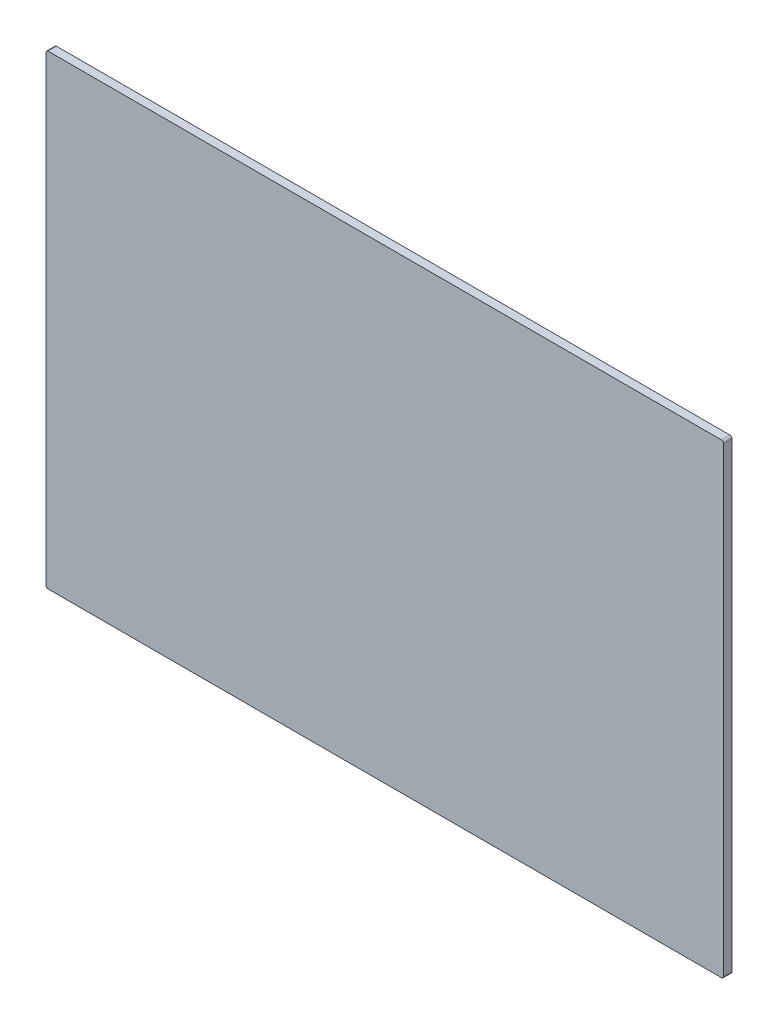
ISO-10303-21;
HEADER;
FILE_DESCRIPTION(('STEP AP214'),'2;1');
FILE_NAME('part.step','',(''),(''),'','','');
FILE_SCHEMA(('AUTOMOTIVE_DESIGN { 1 0 10303 214 1 1 1 1 }'));
ENDSEC;
DATA;
#1=APPLICATION_CONTEXT('core data for automotive mechanical design processes');
#2=APPLICATION_PROTOCOL_DEFINITION('international standard','automotive_design',2000,#1);
#3=PRODUCT_CONTEXT('',#1,'mechanical');
#4=PRODUCT('Part','Part','',(#3));
#5=PRODUCT_RELATED_PRODUCT_CATEGORY('part','',(#4));
#6=PRODUCT_DEFINITION_FORMATION('','',#4);
#7=PRODUCT_DEFINITION_CONTEXT('part definition',#1,'design');
#8=PRODUCT_DEFINITION('design','',#6,#7);
#9=PRODUCT_DEFINITION_SHAPE('','',#8);
#10=(LENGTH_UNIT() NAMED_UNIT(*) SI_UNIT(.MILLI.,.METRE.));
#11=(NAMED_UNIT(*) PLANE_ANGLE_UNIT() SI_UNIT($,.RADIAN.));
#12=(NAMED_UNIT(*) SI_UNIT($,.STERADIAN.) SOLID_ANGLE_UNIT());
#13=UNCERTAINTY_MEASURE_WITH_UNIT(LENGTH_MEASURE(1.E-05),#10,'distance_accuracy_value','');
#14=(GEOMETRIC_REPRESENTATION_CONTEXT(3) GLOBAL_UNCERTAINTY_ASSIGNED_CONTEXT((#13)) GLOBAL_UNIT_ASSIGNED_CONTEXT((#10,
#11,#12)) REPRESENTATION_CONTEXT('',''));
#15=CARTESIAN_POINT('',(0.,0.,0.));
#16=DIRECTION('',(0.,0.,1.));
#17=DIRECTION('',(1.,0.,0.));
#18=AXIS2_PLACEMENT_3D('',#15,#16,#17);
#19=CARTESIAN_POINT('',(1.5,1.5,6.));
#20=DIRECTION('',(0.,0.,-1.));
#21=DIRECTION('',(-1.,0.,0.));
#22=AXIS2_PLACEMENT_3D('',#19,#20,#21);
#23=CYLINDRICAL_SURFACE('',#22,1.5);
#24=CARTESIAN_POINT('',(1.5,1.5,0.));
#25=DIRECTION('',(0.,0.,1.));
#26=DIRECTION('',(1.,0.,0.));
#27=AXIS2_PLACEMENT_3D('',#24,#25,#26);
#28=CIRCLE('',#27,1.5);
#29=CARTESIAN_POINT('',(0.,1.50000000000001,0.));
#30=VERTEX_POINT('',#29);
#31=CARTESIAN_POINT('',(1.50000000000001,0.,0.));
#32=VERTEX_POINT('',#31);
#33=EDGE_CURVE('E94',#30,#32,#28,.T.);
#34=ORIENTED_EDGE('',*,*,#33,.T.);
#35=DIRECTION('',(0.,0.,-1.));
#36=VECTOR('',#35,1.);
#37=CARTESIAN_POINT('',(1.50000000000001,0.,6.));
#38=LINE('',#37,#36);
#39=CARTESIAN_POINT('',(1.50000000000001,0.,6.));
#40=VERTEX_POINT('',#39);
#41=EDGE_CURVE('E11',#40,#32,#38,.T.);
#42=ORIENTED_EDGE('',*,*,#41,.F.);
#43=CARTESIAN_POINT('',(1.5,1.5,6.));
#44=DIRECTION('',(0.,0.,1.));
#45=DIRECTION('',(1.,0.,0.));
#46=AXIS2_PLACEMENT_3D('',#43,#44,#45);
#47=CIRCLE('',#46,1.5);
#48=CARTESIAN_POINT('',(0.,1.50000000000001,6.));
#49=VERTEX_POINT('',#48);
#50=EDGE_CURVE('E121',#49,#40,#47,.T.);
#51=ORIENTED_EDGE('',*,*,#50,.F.);
#52=DIRECTION('',(0.,0.,-1.));
#53=VECTOR('',#52,1.);
#54=CARTESIAN_POINT('',(0.,1.50000000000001,6.));
#55=LINE('',#54,#53);
#56=EDGE_CURVE('E107',#49,#30,#55,.T.);
#57=ORIENTED_EDGE('',*,*,#56,.T.);
#58=EDGE_LOOP('',(#34,#42,#51,#57));
#59=FACE_BOUND('',#58,.T.);
#60=ADVANCED_FACE('F26',(#59),#23,.T.);
#61=CARTESIAN_POINT('',(1.50000000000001,0.,6.));
#62=DIRECTION('',(0.,1.,0.));
#63=DIRECTION('',(0.,0.,1.));
#64=AXIS2_PLACEMENT_3D('',#61,#62,#63);
#65=PLANE('',#64);
#66=DIRECTION('',(1.,0.,0.));
#67=VECTOR('',#66,1.);
#68=CARTESIAN_POINT('',(1.50000000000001,0.,0.));
#69=LINE('',#68,#67);
#70=CARTESIAN_POINT('',(478.5,0.,0.));
#71=VERTEX_POINT('',#70);
#72=EDGE_CURVE('E90',#32,#71,#69,.T.);
#73=ORIENTED_EDGE('',*,*,#72,.T.);
#74=DIRECTION('',(0.,0.,-1.));
#75=VECTOR('',#74,1.);
#76=CARTESIAN_POINT('',(478.5,0.,6.));
#77=LINE('',#76,#75);
#78=CARTESIAN_POINT('',(478.5,0.,6.));
#79=VERTEX_POINT('',#78);
#80=EDGE_CURVE('E33',#79,#71,#77,.T.);
#81=ORIENTED_EDGE('',*,*,#80,.F.);
#82=DIRECTION('',(1.,0.,0.));
#83=VECTOR('',#82,1.);
#84=CARTESIAN_POINT('',(1.50000000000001,0.,6.));
#85=LINE('',#84,#83);
#86=EDGE_CURVE('E103',#40,#79,#85,.T.);
#87=ORIENTED_EDGE('',*,*,#86,.F.);
#88=ORIENTED_EDGE('',*,*,#41,.T.);
#89=EDGE_LOOP('',(#73,#81,#87,#88));
#90=FACE_BOUND('',#89,.T.);
#91=ADVANCED_FACE('F102',(#90),#65,.F.);
#92=CARTESIAN_POINT('',(478.5,1.5,6.));
#93=DIRECTION('',(0.,0.,-1.));
#94=DIRECTION('',(-1.,0.,0.));
#95=AXIS2_PLACEMENT_3D('',#92,#93,#94);
#96=CYLINDRICAL_SURFACE('',#95,1.5);
#97=CARTESIAN_POINT('',(478.5,1.5,0.));
#98=DIRECTION('',(0.,0.,1.));
#99=DIRECTION('',(1.,0.,0.));
#100=AXIS2_PLACEMENT_3D('',#97,#98,#99);
#101=CIRCLE('',#100,1.5);
#102=CARTESIAN_POINT('',(480.,1.5,0.));
#103=VERTEX_POINT('',#102);
#104=EDGE_CURVE('E96',#71,#103,#101,.T.);
#105=ORIENTED_EDGE('',*,*,#104,.T.);
#106=DIRECTION('',(0.,0.,-1.));
#107=VECTOR('',#106,1.);
#108=CARTESIAN_POINT('',(480.,1.5,6.));
#109=LINE('',#108,#107);
#110=CARTESIAN_POINT('',(480.,1.5,6.));
#111=VERTEX_POINT('',#110);
#112=EDGE_CURVE('E147',#111,#103,#109,.T.);
#113=ORIENTED_EDGE('',*,*,#112,.F.);
#114=CARTESIAN_POINT('',(478.5,1.5,6.));
#115=DIRECTION('',(0.,0.,1.));
#116=DIRECTION('',(1.,0.,0.));
#117=AXIS2_PLACEMENT_3D('',#114,#115,#116);
#118=CIRCLE('',#117,1.5);
#119=EDGE_CURVE('E124',#79,#111,#118,.T.);
#120=ORIENTED_EDGE('',*,*,#119,.F.);
#121=ORIENTED_EDGE('',*,*,#80,.T.);
#122=EDGE_LOOP('',(#105,#113,#120,#121));
#123=FACE_BOUND('',#122,.T.);
#124=ADVANCED_FACE('F151',(#123),#96,.T.);
#125=CARTESIAN_POINT('',(480.,1.5,6.));
#126=DIRECTION('',(-1.,0.,0.));
#127=DIRECTION('',(0.,0.,1.));
#128=AXIS2_PLACEMENT_3D('',#125,#126,#127);
#129=PLANE('',#128);
#130=DIRECTION('',(0.,1.,0.));
#131=VECTOR('',#130,1.);
#132=CARTESIAN_POINT('',(480.,1.5,0.));
#133=LINE('',#132,#131);
#134=CARTESIAN_POINT('',(480.,328.5,0.));
#135=VERTEX_POINT('',#134);
#136=EDGE_CURVE('E111',#103,#135,#133,.T.);
#137=ORIENTED_EDGE('',*,*,#136,.T.);
#138=DIRECTION('',(0.,0.,-1.));
#139=VECTOR('',#138,1.);
#140=CARTESIAN_POINT('',(480.,328.5,6.));
#141=LINE('',#140,#139);
#142=CARTESIAN_POINT('',(480.,328.5,6.));
#143=VERTEX_POINT('',#142);
#144=EDGE_CURVE('E144',#143,#135,#141,.T.);
#145=ORIENTED_EDGE('',*,*,#144,.F.);
#146=DIRECTION('',(0.,1.,0.));
#147=VECTOR('',#146,1.);
#148=CARTESIAN_POINT('',(480.,1.5,6.));
#149=LINE('',#148,#147);
#150=EDGE_CURVE('E126',#111,#143,#149,.T.);
#151=ORIENTED_EDGE('',*,*,#150,.F.);
#152=ORIENTED_EDGE('',*,*,#112,.T.);
#153=EDGE_LOOP('',(#137,#145,#151,#152));
#154=FACE_BOUND('',#153,.T.);
#155=ADVANCED_FACE('F159',(#154),#129,.F.);
#156=CARTESIAN_POINT('',(478.5,328.5,6.));
#157=DIRECTION('',(0.,0.,-1.));
#158=DIRECTION('',(-1.,0.,0.));
#159=AXIS2_PLACEMENT_3D('',#156,#157,#158);
#160=CYLINDRICAL_SURFACE('',#159,1.5);
#161=CARTESIAN_POINT('',(478.5,328.5,0.));
#162=DIRECTION('',(0.,0.,1.));
#163=DIRECTION('',(1.,0.,0.));
#164=AXIS2_PLACEMENT_3D('',#161,#162,#163);
#165=CIRCLE('',#164,1.5);
#166=CARTESIAN_POINT('',(478.5,330.,0.));
#167=VERTEX_POINT('',#166);
#168=EDGE_CURVE('E113',#135,#167,#165,.T.);
#169=ORIENTED_EDGE('',*,*,#168,.T.);
#170=DIRECTION('',(0.,0.,-1.));
#171=VECTOR('',#170,1.);
#172=CARTESIAN_POINT('',(478.5,330.,6.));
#173=LINE('',#172,#171);
#174=CARTESIAN_POINT('',(478.5,330.,6.));
#175=VERTEX_POINT('',#174);
#176=EDGE_CURVE('E141',#175,#167,#173,.T.);
#177=ORIENTED_EDGE('',*,*,#176,.F.);
#178=CARTESIAN_POINT('',(478.5,328.5,6.));
#179=DIRECTION('',(0.,0.,1.));
#180=DIRECTION('',(1.,0.,0.));
#181=AXIS2_PLACEMENT_3D('',#178,#179,#180);
#182=CIRCLE('',#181,1.5);
#183=EDGE_CURVE('E128',#143,#175,#182,.T.);
#184=ORIENTED_EDGE('',*,*,#183,.F.);
#185=ORIENTED_EDGE('',*,*,#144,.T.);
#186=EDGE_LOOP('',(#169,#177,#184,#185));
#187=FACE_BOUND('',#186,.T.);
#188=ADVANCED_FACE('F162',(#187),#160,.T.);
#189=CARTESIAN_POINT('',(1.5,330.,6.));
#190=DIRECTION('',(0.,-1.,0.));
#191=DIRECTION('',(0.,0.,-1.));
#192=AXIS2_PLACEMENT_3D('',#189,#190,#191);
#193=PLANE('',#192);
#194=DIRECTION('',(-1.,0.,0.));
#195=VECTOR('',#194,1.);
#196=CARTESIAN_POINT('',(1.5,330.,0.));
#197=LINE('',#196,#195);
#198=CARTESIAN_POINT('',(1.5,330.,0.));
#199=VERTEX_POINT('',#198);
#200=EDGE_CURVE('E115',#167,#199,#197,.T.);
#201=ORIENTED_EDGE('',*,*,#200,.T.);
#202=DIRECTION('',(0.,0.,-1.));
#203=VECTOR('',#202,1.);
#204=CARTESIAN_POINT('',(1.5,330.,6.));
#205=LINE('',#204,#203);
#206=CARTESIAN_POINT('',(1.5,330.,6.));
#207=VERTEX_POINT('',#206);
#208=EDGE_CURVE('E138',#207,#199,#205,.T.);
#209=ORIENTED_EDGE('',*,*,#208,.F.);
#210=DIRECTION('',(-1.,0.,0.));
#211=VECTOR('',#210,1.);
#212=CARTESIAN_POINT('',(1.5,330.,6.));
#213=LINE('',#212,#211);
#214=EDGE_CURVE('E130',#175,#207,#213,.T.);
#215=ORIENTED_EDGE('',*,*,#214,.F.);
#216=ORIENTED_EDGE('',*,*,#176,.T.);
#217=EDGE_LOOP('',(#201,#209,#215,#216));
#218=FACE_BOUND('',#217,.T.);
#219=ADVANCED_FACE('F167',(#218),#193,.F.);
#220=CARTESIAN_POINT('',(1.5,328.5,6.));
#221=DIRECTION('',(0.,0.,-1.));
#222=DIRECTION('',(-1.,0.,0.));
#223=AXIS2_PLACEMENT_3D('',#220,#221,#222);
#224=CYLINDRICAL_SURFACE('',#223,1.5);
#225=CARTESIAN_POINT('',(1.5,328.5,0.));
#226=DIRECTION('',(0.,0.,1.));
#227=DIRECTION('',(1.,0.,0.));
#228=AXIS2_PLACEMENT_3D('',#225,#226,#227);
#229=CIRCLE('',#228,1.5);
#230=CARTESIAN_POINT('',(0.,328.5,0.));
#231=VERTEX_POINT('',#230);
#232=EDGE_CURVE('E117',#199,#231,#229,.T.);
#233=ORIENTED_EDGE('',*,*,#232,.T.);
#234=DIRECTION('',(0.,0.,-1.));
#235=VECTOR('',#234,1.);
#236=CARTESIAN_POINT('',(0.,328.5,6.));
#237=LINE('',#236,#235);
#238=CARTESIAN_POINT('',(0.,328.5,6.));
#239=VERTEX_POINT('',#238);
#240=EDGE_CURVE('E135',#239,#231,#237,.T.);
#241=ORIENTED_EDGE('',*,*,#240,.F.);
#242=CARTESIAN_POINT('',(1.5,328.5,6.));
#243=DIRECTION('',(0.,0.,1.));
#244=DIRECTION('',(1.,0.,0.));
#245=AXIS2_PLACEMENT_3D('',#242,#243,#244);
#246=CIRCLE('',#245,1.5);
#247=EDGE_CURVE('E45',#207,#239,#246,.T.);
#248=ORIENTED_EDGE('',*,*,#247,.F.);
#249=ORIENTED_EDGE('',*,*,#208,.T.);
#250=EDGE_LOOP('',(#233,#241,#248,#249));
#251=FACE_BOUND('',#250,.T.);
#252=ADVANCED_FACE('F170',(#251),#224,.T.);
#253=CARTESIAN_POINT('',(0.,1.50000000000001,6.));
#254=DIRECTION('',(1.,0.,0.));
#255=DIRECTION('',(0.,0.,-1.));
#256=AXIS2_PLACEMENT_3D('',#253,#254,#255);
#257=PLANE('',#256);
#258=DIRECTION('',(0.,-1.,0.));
#259=VECTOR('',#258,1.);
#260=CARTESIAN_POINT('',(0.,1.50000000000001,0.));
#261=LINE('',#260,#259);
#262=EDGE_CURVE('E119',#231,#30,#261,.T.);
#263=ORIENTED_EDGE('',*,*,#262,.T.);
#264=ORIENTED_EDGE('',*,*,#56,.F.);
#265=DIRECTION('',(0.,-1.,0.));
#266=VECTOR('',#265,1.);
#267=CARTESIAN_POINT('',(0.,1.50000000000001,6.));
#268=LINE('',#267,#266);
#269=EDGE_CURVE('E40',#239,#49,#268,.T.);
#270=ORIENTED_EDGE('',*,*,#269,.F.);
#271=ORIENTED_EDGE('',*,*,#240,.T.);
#272=EDGE_LOOP('',(#263,#264,#270,#271));
#273=FACE_BOUND('',#272,.T.);
#274=ADVANCED_FACE('F172',(#273),#257,.F.);
#275=CARTESIAN_POINT('',(1.5,1.5,6.));
#276=DIRECTION('',(0.,0.,1.));
#277=DIRECTION('',(1.,0.,0.));
#278=AXIS2_PLACEMENT_3D('',#275,#276,#277);
#279=PLANE('',#278);
#280=ORIENTED_EDGE('',*,*,#50,.T.);
#281=ORIENTED_EDGE('',*,*,#86,.T.);
#282=ORIENTED_EDGE('',*,*,#119,.T.);
#283=ORIENTED_EDGE('',*,*,#150,.T.);
#284=ORIENTED_EDGE('',*,*,#183,.T.);
#285=ORIENTED_EDGE('',*,*,#214,.T.);
#286=ORIENTED_EDGE('',*,*,#247,.T.);
#287=ORIENTED_EDGE('',*,*,#269,.T.);
#288=EDGE_LOOP('',(#280,#281,#282,#283,#284,#285,#286,#287));
#289=FACE_BOUND('',#288,.T.);
#290=ADVANCED_FACE('F154',(#289),#279,.T.);
#291=CARTESIAN_POINT('',(1.5,1.5,0.));
#292=DIRECTION('',(0.,0.,1.));
#293=DIRECTION('',(1.,0.,0.));
#294=AXIS2_PLACEMENT_3D('',#291,#292,#293);
#295=PLANE('',#294);
#296=ORIENTED_EDGE('',*,*,#33,.F.);
#297=ORIENTED_EDGE('',*,*,#262,.F.);
#298=ORIENTED_EDGE('',*,*,#232,.F.);
#299=ORIENTED_EDGE('',*,*,#200,.F.);
#300=ORIENTED_EDGE('',*,*,#168,.F.);
#301=ORIENTED_EDGE('',*,*,#136,.F.);
#302=ORIENTED_EDGE('',*,*,#104,.F.);
#303=ORIENTED_EDGE('',*,*,#72,.F.);
#304=EDGE_LOOP('',(#296,#297,#298,#299,#300,#301,#302,#303));
#305=FACE_BOUND('',#304,.T.);
#306=ADVANCED_FACE('F91',(#305),#295,.F.);
#307=CLOSED_SHELL('',(#60,#91,#124,#155,#188,#219,#252,#274,#290,#306));
#308=MANIFOLD_SOLID_BREP('B2',#307);
#309=ADVANCED_BREP_SHAPE_REPRESENTATION('',(#18,#308),#14);
#310=SHAPE_DEFINITION_REPRESENTATION(#9,#309);
ENDSEC;
END-ISO-10303-21;
